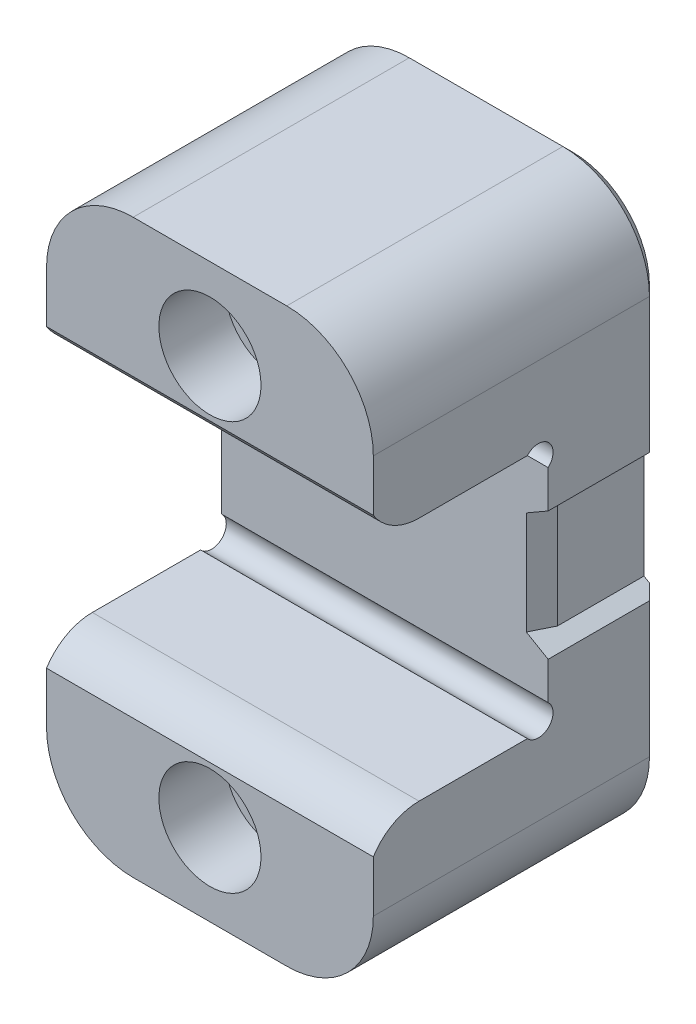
from build123d import *

# Parameters (mm, degrees)
EXTRUDE1_DEPTH             = 25.4
FILLET1_R                  = 13.462
CUT_EXTRUDE1_DEPTH         = 77.989658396
CUT_EXTRUDE2_DEPTH         = 81.82230509
SKETCH6_R                  = 2.286
CUT_EXTRUDE3_DEPTH         = 81.82230509
F_3_8_16_CBORE_D           = 9.525
F_3_8_16_CBORE_CBORE_D     = 15.875
F_3_8_16_CBORE_CBORE_DEPTH = 10.32002
F_1_2_13_TAPPED_HOLE1_D    = 10.71626
CHAMFER3_SIZE              = 3.81
CHAMFER3_SIZE2             = 1.020886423
CHAMFER1_SIZE              = 1.524


with BuildPart() as part:
    # Sketch1 → Extrude1 (new, symmetric)
    with BuildSketch(Plane(origin=(0, 0, 0), x_dir=(0, 0, -1), z_dir=(1, 0, 0))):
        Polygon((0, 19.05), (27.178, 19.05), (27.178, -19.05), (0, -19.05), (0, -44.45), (44.45, -44.45), (44.45, 44.45), (0, 44.45), align=None)
    extrude(amount=EXTRUDE1_DEPTH, both=True)

    # Fillet1
    fillet1_edges = [part.edges().sort_by_distance(p)[0] for p in [
        (25.4, -44.45, -22.225),
        (25.4, 44.45, -22.225),
        (-25.4, 44.45, -22.225),
        (-25.4, -44.45, -22.225),
    ]]
    fillet(fillet1_edges, radius=FILLET1_R)

    # Sketch2 → Cut-Extrude1 (cut, through all)
    with BuildSketch(Plane(origin=(-19.05, 0, -44.45), x_dir=(1, 0, 0), z_dir=(0, 0, 1))):
        Polygon((42.06875, 8.608456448), (45.24375, 10.441543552), (45.24375, -10.441543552), (42.06875, -8.608456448), align=None)
    extrude(amount=CUT_EXTRUDE1_DEPTH, mode=Mode.SUBTRACT)

    # Sketch5 → Cut-Extrude2 (cut, through all)
    with BuildSketch(Plane(origin=(25.4, 0, 0), x_dir=(0, 0, -1), z_dir=(1, 0, 0))):
        with BuildLine():
            Line((-5.588, -13.470286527), (7.112, -13.470286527))
            Line((7.112, -13.470286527), (7.112, -19.05))
            ThreePointArc((7.112, -19.05), (3.045495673, -20.102378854), (0, -22.995286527))
            Line((0, -22.995286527), (-5.588, -22.995286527))
            Line((-5.588, -22.995286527), (-5.588, -13.470286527))
        make_face()
        with BuildLine():
            Line((7.112, 13.470286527), (7.112, 19.05))
            ThreePointArc((7.112, 19.05), (3.045495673, 20.102378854), (0, 22.995286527))
            Line((0, 22.995286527), (-5.588, 22.995286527))
            Line((-5.588, 22.995286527), (-5.588, 13.470286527))
            Line((-5.588, 13.470286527), (7.112, 13.470286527))
        make_face()
    extrude(amount=-CUT_EXTRUDE2_DEPTH, mode=Mode.SUBTRACT)

    # Sketch6 → Cut-Extrude3 (cut, through all)
    with BuildSketch(Plane(origin=(25.4, 0, 0), x_dir=(0, 0, -1), z_dir=(1, 0, 0))):
        with Locations((25.654, 17.526)):
            Circle(SKETCH6_R)
        with Locations((25.654, -17.526)):
            Circle(SKETCH6_R)
    extrude(amount=-CUT_EXTRUDE3_DEPTH, mode=Mode.SUBTRACT)

    # 3_8_-16 CBORE (through all)
    with Locations(Plane.XY):
        with Locations((0, 31.75), (0, -31.75)):
            CounterBoreHole(F_3_8_16_CBORE_D / 2, F_3_8_16_CBORE_CBORE_D / 2, F_3_8_16_CBORE_CBORE_DEPTH)

    # 1_2-13 Tapped Hole1 (through all)
    with Locations(Plane.XY.offset(-10.32002)):
        with Locations((0, 31.75), (0, -31.75)):
            Hole(F_1_2_13_TAPPED_HOLE1_D / 2)

    # Chamfer3
    chamfer3_edges = [part.edges().sort_by_distance(p)[0] for p in [
        (23.01875, 0, -27.178),
    ]]
    chamfer3_side = [part.faces().sort_by_distance(p)[0] for p in [
        (23.01875, 0, -35.814),
    ]]
    chamfer(chamfer3_edges, length=CHAMFER3_SIZE, length2=CHAMFER3_SIZE2, reference=chamfer3_side[0])

    # Chamfer1
    chamfer1_edges = [part.edges().sort_by_distance(p)[0] for p in [
        (25.4, -20.485635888, -44.45),
        (-25.4, 0, -44.45),
        (0, 44.45, -44.45),
        (0, -44.45, -44.45),
        (-21.457071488, 40.507071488, -44.45),
        (-21.457071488, -40.507071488, -44.45),
        (21.457071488, 40.507071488, -44.45),
        (21.457071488, -40.507071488, -44.45),
        (25.4, 20.485635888, -44.45),
    ]]
    chamfer(chamfer1_edges, length=CHAMFER1_SIZE)


solid = part.part
